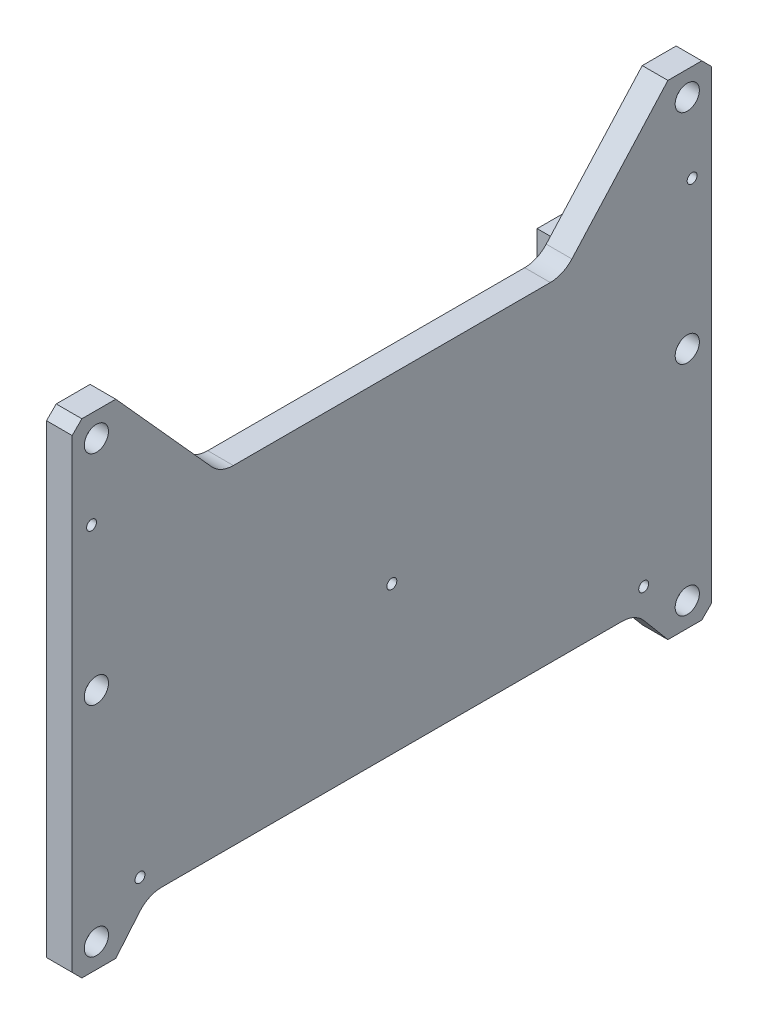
from build123d import *

# Parameters (mm, degrees)
EXTRUDE_1_DEPTH                                    = 5.3
CHAMFER_1_SIZE                                     = 2
FILLET_1_R                                         = 6
SKETCH_2_W                                         = 20
SKETCH_2_H                                         = 16
EXTRUDE_2_DEPTH                                    = 4.7
EXTRUDE_3_DEPTH                                    = 3.8
SKETCH_4_W                                         = 37
SKETCH_4_H                                         = 26
CUT_EXTRUDE_1_DEPTH                                = 3.9
FILLET_2_R                                         = 3
HOLE_WIZARD_M41_D                                  = 3.3
CBORE_FOR_M4_CHEESE_HEAD_SCREW_14912_D             = 3
CBORE_FOR_M4_CHEESE_HEAD_SCREW_14912_CBORE_D       = 5
CBORE_FOR_M4_CHEESE_HEAD_SCREW_14912_CBORE_DEPTH   = 3.5
HOLE_WIZARD_M2_51_D                                = 2.05
CBORE_FOR_M2_5_CHEESE_HEAD_SCREW_14911_D           = 2
CBORE_FOR_M2_5_CHEESE_HEAD_SCREW_14911_CBORE_D     = 5.2
CBORE_FOR_M2_5_CHEESE_HEAD_SCREW_14911_CBORE_DEPTH = 0.5


with BuildPart() as part:
    # Sketch 1 → Extrude 1 (new body)
    with BuildSketch(Plane.ZY):
        Polygon((-66, 50), (-57, 50), (-35.390302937, 26), (35.390302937, 26), (57, 50), (66, 50), (66, -50), (57, -50), (50.287202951, -42), (-50.287202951, -42), (-57, -50), (-66, -50), align=None)
    extrude(amount=EXTRUDE_1_DEPTH)

    # Chamfer 1
    chamfer_1_edges = [part.edges().sort_by_distance(p)[0] for p in [
        (-2.65, 50, -66),
        (-2.65, 50, 66),
        (-2.65, -50, 66),
        (-2.65, -50, -66),
    ]]
    chamfer(chamfer_1_edges, length=CHAMFER_1_SIZE)

    # Fillet 1
    fillet_1_edges = [part.edges().sort_by_distance(p)[0] for p in [
        (-2.65, 26, -35.390302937),
        (-2.65, 26, 35.390302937),
        (-2.65, -42, 50.287202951),
        (-2.65, -42, -50.287202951),
    ]]
    fillet(fillet_1_edges, radius=FILLET_1_R)

    # Sketch 2 → Extrude 2 (add)
    with BuildSketch(Plane.ZY.offset(5.3)):
        with Locations((-50, 19)):
            Rectangle(SKETCH_2_W, SKETCH_2_H)
    extrude(amount=EXTRUDE_2_DEPTH)

    # Sketch 3 → Extrude 3 (add)
    with BuildSketch(Plane.ZY.offset(5.3)):
        with BuildLine():
            Line((-15, 4), (-34, 4))
            ThreePointArc((-34, 4), (-38.242640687, 5.757359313), (-40, 10))
            Line((-40, 10), (-40, 11))
            Line((-40, 11), (-57, 11))
            ThreePointArc((-57, 11), (-52.757359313, 9.242640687), (-51, 5))
            Line((-51, 5), (-51, 4))
            Line((-51, 4), (-51, -33))
            Line((-51, -33), (-15, -33))
            Line((-15, -33), (-15, 4))
        make_face()
    extrude(amount=EXTRUDE_3_DEPTH)

    # Sketch 4 → Cut-Extrude 1 (cut)
    with BuildSketch(Plane.ZY.offset(5.3)):
        with Locations((36.5, -21)):
            Rectangle(SKETCH_4_W, SKETCH_4_H)
    extrude(amount=-CUT_EXTRUDE_1_DEPTH, mode=Mode.SUBTRACT)

    # Fillet 2
    fillet_2_edges = [part.edges().sort_by_distance(p)[0] for p in [
        (-3.35, -34, 18),
        (-3.35, -8, 18),
        (-3.35, -8, 55),
        (-3.35, -34, 55),
    ]]
    fillet(fillet_2_edges, radius=FILLET_2_R)

    # Hole Wizard M41 (through all)
    with Locations(Plane(origin=(0, 0, 0), x_dir=(0, 0, -1), z_dir=(1, 0, 0))):
        with Locations((-61, 45), (61, 45), (61, -45), (-61, -45), (-61, 0), (61, 0)):
            Hole(HOLE_WIZARD_M41_D / 2)

    # CBORE for M4 Cheese Head Screw 14912 (through all)
    with Locations(Plane(origin=(0, 0, 0), x_dir=(0, 0, -1), z_dir=(1, 0, 0))):
        with Locations((-61, 45), (-61, 0), (-61, -45), (61, -45), (61, 0), (61, 45)):
            CounterBoreHole(CBORE_FOR_M4_CHEESE_HEAD_SCREW_14912_D / 2, CBORE_FOR_M4_CHEESE_HEAD_SCREW_14912_CBORE_D / 2, CBORE_FOR_M4_CHEESE_HEAD_SCREW_14912_CBORE_DEPTH)

    # Hole Wizard M2_51 (through all)
    with Locations(Plane.ZY.offset(5.3)):
        with Locations((-62, 30), (62, 30), (-52, -38), (52, -38), (0, -11.5)):
            Hole(HOLE_WIZARD_M2_51_D / 2)

    # CBORE for M2_5 Cheese Head Screw 14911 (through all)
    with Locations(Plane.ZY.offset(5.3)):
        with Locations((-62, 30), (0, -11.5), (62, 30), (52, -38), (-52, -38)):
            CounterBoreHole(CBORE_FOR_M2_5_CHEESE_HEAD_SCREW_14911_D / 2, CBORE_FOR_M2_5_CHEESE_HEAD_SCREW_14911_CBORE_D / 2, CBORE_FOR_M2_5_CHEESE_HEAD_SCREW_14911_CBORE_DEPTH)


solid = part.part
